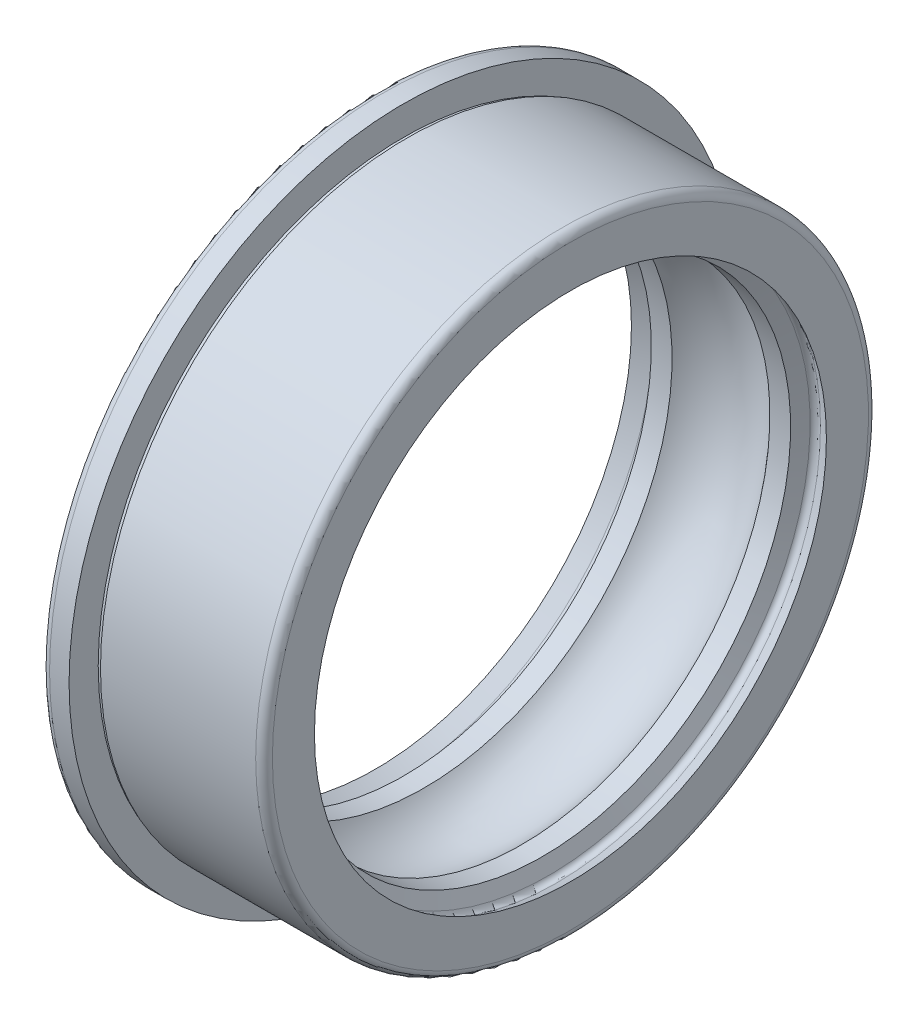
ISO-10303-21;
HEADER;
FILE_DESCRIPTION(('STEP AP214'),'2;1');
FILE_NAME('part.step','',(''),(''),'','','');
FILE_SCHEMA(('AUTOMOTIVE_DESIGN { 1 0 10303 214 1 1 1 1 }'));
ENDSEC;
DATA;
#1=APPLICATION_CONTEXT('core data for automotive mechanical design processes');
#2=APPLICATION_PROTOCOL_DEFINITION('international standard','automotive_design',2000,#1);
#3=PRODUCT_CONTEXT('',#1,'mechanical');
#4=PRODUCT('Part','Part','',(#3));
#5=PRODUCT_RELATED_PRODUCT_CATEGORY('part','',(#4));
#6=PRODUCT_DEFINITION_FORMATION('','',#4);
#7=PRODUCT_DEFINITION_CONTEXT('part definition',#1,'design');
#8=PRODUCT_DEFINITION('design','',#6,#7);
#9=PRODUCT_DEFINITION_SHAPE('','',#8);
#10=(LENGTH_UNIT() NAMED_UNIT(*) SI_UNIT(.MILLI.,.METRE.));
#11=(NAMED_UNIT(*) PLANE_ANGLE_UNIT() SI_UNIT($,.RADIAN.));
#12=(NAMED_UNIT(*) SI_UNIT($,.STERADIAN.) SOLID_ANGLE_UNIT());
#13=UNCERTAINTY_MEASURE_WITH_UNIT(LENGTH_MEASURE(1.E-05),#10,'distance_accuracy_value','');
#14=(GEOMETRIC_REPRESENTATION_CONTEXT(3) GLOBAL_UNCERTAINTY_ASSIGNED_CONTEXT((#13)) GLOBAL_UNIT_ASSIGNED_CONTEXT((#10,
#11,#12)) REPRESENTATION_CONTEXT('',''));
#15=CARTESIAN_POINT('',(0.,0.,0.));
#16=DIRECTION('',(0.,0.,1.));
#17=DIRECTION('',(1.,0.,0.));
#18=AXIS2_PLACEMENT_3D('',#15,#16,#17);
#19=CARTESIAN_POINT('',(0.6,0.,0.));
#20=DIRECTION('',(-1.,0.,0.));
#21=DIRECTION('',(0.,0.,1.));
#22=AXIS2_PLACEMENT_3D('',#19,#20,#21);
#23=TOROIDAL_SURFACE('',#22,9.30625000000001,0.2);
#24=CARTESIAN_POINT('',(0.782287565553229,0.,0.));
#25=DIRECTION('',(-1.,0.,0.));
#26=DIRECTION('',(0.,0.,1.));
#27=AXIS2_PLACEMENT_3D('',#24,#25,#26);
#28=CIRCLE('',#27,9.38853756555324);
#29=CARTESIAN_POINT('',(0.782287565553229,0.,9.38853756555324));
#30=VERTEX_POINT('',#29);
#31=EDGE_CURVE('E10',#30,#30,#28,.T.);
#32=ORIENTED_EDGE('',*,*,#31,.F.);
#33=EDGE_LOOP('',(#32));
#34=FACE_BOUND('',#33,.T.);
#35=CARTESIAN_POINT('',(0.5,0.,0.));
#36=DIRECTION('',(-1.,0.,0.));
#37=DIRECTION('',(0.,0.,1.));
#38=AXIS2_PLACEMENT_3D('',#35,#36,#37);
#39=CIRCLE('',#38,9.4794550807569);
#40=CARTESIAN_POINT('',(0.5,0.,9.4794550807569));
#41=VERTEX_POINT('',#40);
#42=EDGE_CURVE('E89',#41,#41,#39,.T.);
#43=ORIENTED_EDGE('',*,*,#42,.T.);
#44=EDGE_LOOP('',(#43));
#45=FACE_BOUND('',#44,.T.);
#46=ADVANCED_FACE('F31',(#34,#45),#23,.F.);
#47=CARTESIAN_POINT('',(0.782287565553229,0.,0.));
#48=DIRECTION('',(-1.,0.,0.));
#49=DIRECTION('',(0.,0.,1.));
#50=AXIS2_PLACEMENT_3D('',#47,#48,#49);
#51=CONICAL_SURFACE('',#50,9.38853756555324,1.14676528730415);
#52=CARTESIAN_POINT('',(1.,0.,0.));
#53=DIRECTION('',(-1.,0.,0.));
#54=DIRECTION('',(0.,0.,1.));
#55=AXIS2_PLACEMENT_3D('',#52,#53,#54);
#56=CIRCLE('',#55,8.90625000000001);
#57=CARTESIAN_POINT('',(1.,0.,8.90625000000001));
#58=VERTEX_POINT('',#57);
#59=EDGE_CURVE('E37',#58,#58,#56,.T.);
#60=ORIENTED_EDGE('',*,*,#59,.F.);
#61=EDGE_LOOP('',(#60));
#62=FACE_BOUND('',#61,.T.);
#63=ORIENTED_EDGE('',*,*,#31,.T.);
#64=EDGE_LOOP('',(#63));
#65=FACE_BOUND('',#64,.T.);
#66=ADVANCED_FACE('F186',(#62,#65),#51,.F.);
#67=CARTESIAN_POINT('',(-13.,0.,0.));
#68=DIRECTION('',(-1.,0.,0.));
#69=DIRECTION('',(0.,0.,1.));
#70=AXIS2_PLACEMENT_3D('',#67,#68,#69);
#71=CYLINDRICAL_SURFACE('',#70,8.90625000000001);
#72=CARTESIAN_POINT('',(1.74359431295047,0.,0.));
#73=DIRECTION('',(-1.,0.,0.));
#74=DIRECTION('',(0.,0.,1.));
#75=AXIS2_PLACEMENT_3D('',#72,#73,#74);
#76=CIRCLE('',#75,8.90625000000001);
#77=CARTESIAN_POINT('',(1.74359431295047,0.,8.90625000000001));
#78=VERTEX_POINT('',#77);
#79=EDGE_CURVE('E41',#78,#78,#76,.T.);
#80=ORIENTED_EDGE('',*,*,#79,.F.);
#81=EDGE_LOOP('',(#80));
#82=FACE_BOUND('',#81,.T.);
#83=ORIENTED_EDGE('',*,*,#59,.T.);
#84=EDGE_LOOP('',(#83));
#85=FACE_BOUND('',#84,.T.);
#86=ADVANCED_FACE('F181',(#82,#85),#71,.F.);
#87=CARTESIAN_POINT('',(3.5,0.,0.));
#88=DIRECTION('',(-1.,0.,0.));
#89=DIRECTION('',(0.,0.,1.));
#90=AXIS2_PLACEMENT_3D('',#87,#88,#89);
#91=TOROIDAL_SURFACE('',#90,7.5,2.25);
#92=CARTESIAN_POINT('',(5.25640568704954,0.,0.));
#93=DIRECTION('',(-1.,0.,0.));
#94=DIRECTION('',(0.,0.,1.));
#95=AXIS2_PLACEMENT_3D('',#92,#93,#94);
#96=CIRCLE('',#95,8.90625000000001);
#97=CARTESIAN_POINT('',(5.25640568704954,0.,8.90625000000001));
#98=VERTEX_POINT('',#97);
#99=EDGE_CURVE('E45',#98,#98,#96,.T.);
#100=ORIENTED_EDGE('',*,*,#99,.F.);
#101=EDGE_LOOP('',(#100));
#102=FACE_BOUND('',#101,.T.);
#103=ORIENTED_EDGE('',*,*,#79,.T.);
#104=EDGE_LOOP('',(#103));
#105=FACE_BOUND('',#104,.T.);
#106=ADVANCED_FACE('F175',(#102,#105),#91,.F.);
#107=CARTESIAN_POINT('',(-13.,0.,0.));
#108=DIRECTION('',(-1.,0.,0.));
#109=DIRECTION('',(0.,0.,1.));
#110=AXIS2_PLACEMENT_3D('',#107,#108,#109);
#111=CYLINDRICAL_SURFACE('',#110,8.90625000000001);
#112=CARTESIAN_POINT('',(6.,0.,0.));
#113=DIRECTION('',(-1.,0.,0.));
#114=DIRECTION('',(0.,0.,1.));
#115=AXIS2_PLACEMENT_3D('',#112,#113,#114);
#116=CIRCLE('',#115,8.90625000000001);
#117=CARTESIAN_POINT('',(6.,0.,8.90625000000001));
#118=VERTEX_POINT('',#117);
#119=EDGE_CURVE('E50',#118,#118,#116,.T.);
#120=ORIENTED_EDGE('',*,*,#119,.F.);
#121=EDGE_LOOP('',(#120));
#122=FACE_BOUND('',#121,.T.);
#123=ORIENTED_EDGE('',*,*,#99,.T.);
#124=EDGE_LOOP('',(#123));
#125=FACE_BOUND('',#124,.T.);
#126=ADVANCED_FACE('F169',(#122,#125),#111,.F.);
#127=CARTESIAN_POINT('',(6.,0.,0.));
#128=DIRECTION('',(1.,0.,0.));
#129=DIRECTION('',(0.,0.,-1.));
#130=AXIS2_PLACEMENT_3D('',#127,#128,#129);
#131=CONICAL_SURFACE('',#130,8.90625000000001,1.14676528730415);
#132=CARTESIAN_POINT('',(6.21771243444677,0.,0.));
#133=DIRECTION('',(-1.,0.,0.));
#134=DIRECTION('',(0.,0.,1.));
#135=AXIS2_PLACEMENT_3D('',#132,#133,#134);
#136=CIRCLE('',#135,9.38853756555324);
#137=CARTESIAN_POINT('',(6.21771243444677,0.,9.38853756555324));
#138=VERTEX_POINT('',#137);
#139=EDGE_CURVE('E53',#138,#138,#136,.T.);
#140=ORIENTED_EDGE('',*,*,#139,.F.);
#141=EDGE_LOOP('',(#140));
#142=FACE_BOUND('',#141,.T.);
#143=ORIENTED_EDGE('',*,*,#119,.T.);
#144=EDGE_LOOP('',(#143));
#145=FACE_BOUND('',#144,.T.);
#146=ADVANCED_FACE('F163',(#142,#145),#131,.F.);
#147=CARTESIAN_POINT('',(6.4,0.,0.));
#148=DIRECTION('',(-1.,0.,0.));
#149=DIRECTION('',(0.,0.,1.));
#150=AXIS2_PLACEMENT_3D('',#147,#148,#149);
#151=TOROIDAL_SURFACE('',#150,9.30625000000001,0.2);
#152=CARTESIAN_POINT('',(6.5,0.,0.));
#153=DIRECTION('',(-1.,0.,0.));
#154=DIRECTION('',(0.,0.,1.));
#155=AXIS2_PLACEMENT_3D('',#152,#153,#154);
#156=CIRCLE('',#155,9.4794550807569);
#157=CARTESIAN_POINT('',(6.5,0.,9.4794550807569));
#158=VERTEX_POINT('',#157);
#159=EDGE_CURVE('E56',#158,#158,#156,.T.);
#160=ORIENTED_EDGE('',*,*,#159,.F.);
#161=EDGE_LOOP('',(#160));
#162=FACE_BOUND('',#161,.T.);
#163=ORIENTED_EDGE('',*,*,#139,.T.);
#164=EDGE_LOOP('',(#163));
#165=FACE_BOUND('',#164,.T.);
#166=ADVANCED_FACE('F157',(#162,#165),#151,.F.);
#167=CARTESIAN_POINT('',(6.5,0.,0.));
#168=DIRECTION('',(-1.,0.,0.));
#169=DIRECTION('',(0.,0.,1.));
#170=AXIS2_PLACEMENT_3D('',#167,#168,#169);
#171=CONICAL_SURFACE('',#170,9.4794550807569,0.523598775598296);
#172=CARTESIAN_POINT('',(7.,0.,0.));
#173=DIRECTION('',(-1.,0.,0.));
#174=DIRECTION('',(0.,0.,1.));
#175=AXIS2_PLACEMENT_3D('',#172,#173,#174);
#176=CIRCLE('',#175,9.19077994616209);
#177=CARTESIAN_POINT('',(7.,0.,9.19077994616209));
#178=VERTEX_POINT('',#177);
#179=EDGE_CURVE('E59',#178,#178,#176,.T.);
#180=ORIENTED_EDGE('',*,*,#179,.F.);
#181=EDGE_LOOP('',(#180));
#182=FACE_BOUND('',#181,.T.);
#183=ORIENTED_EDGE('',*,*,#159,.T.);
#184=EDGE_LOOP('',(#183));
#185=FACE_BOUND('',#184,.T.);
#186=ADVANCED_FACE('F151',(#182,#185),#171,.F.);
#187=CARTESIAN_POINT('',(7.,10.7,0.));
#188=DIRECTION('',(-1.,0.,0.));
#189=DIRECTION('',(0.,0.,1.));
#190=AXIS2_PLACEMENT_3D('',#187,#188,#189);
#191=PLANE('',#190);
#192=CARTESIAN_POINT('',(7.,0.,0.));
#193=DIRECTION('',(-1.,0.,0.));
#194=DIRECTION('',(0.,0.,1.));
#195=AXIS2_PLACEMENT_3D('',#192,#193,#194);
#196=CIRCLE('',#195,10.7);
#197=CARTESIAN_POINT('',(7.,0.,10.7));
#198=VERTEX_POINT('',#197);
#199=EDGE_CURVE('E62',#198,#198,#196,.T.);
#200=ORIENTED_EDGE('',*,*,#199,.F.);
#201=EDGE_LOOP('',(#200));
#202=FACE_BOUND('',#201,.T.);
#203=ORIENTED_EDGE('',*,*,#179,.T.);
#204=EDGE_LOOP('',(#203));
#205=FACE_BOUND('',#204,.T.);
#206=ADVANCED_FACE('F145',(#202,#205),#191,.F.);
#207=CARTESIAN_POINT('',(6.7,0.,0.));
#208=DIRECTION('',(-1.,0.,0.));
#209=DIRECTION('',(0.,0.,1.));
#210=AXIS2_PLACEMENT_3D('',#207,#208,#209);
#211=TOROIDAL_SURFACE('',#210,10.7,0.300000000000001);
#212=CARTESIAN_POINT('',(6.7,0.,0.));
#213=DIRECTION('',(-1.,0.,0.));
#214=DIRECTION('',(0.,0.,1.));
#215=AXIS2_PLACEMENT_3D('',#212,#213,#214);
#216=CIRCLE('',#215,11.);
#217=CARTESIAN_POINT('',(6.7,0.,11.));
#218=VERTEX_POINT('',#217);
#219=EDGE_CURVE('E65',#218,#218,#216,.T.);
#220=ORIENTED_EDGE('',*,*,#219,.F.);
#221=EDGE_LOOP('',(#220));
#222=FACE_BOUND('',#221,.T.);
#223=ORIENTED_EDGE('',*,*,#199,.T.);
#224=EDGE_LOOP('',(#223));
#225=FACE_BOUND('',#224,.T.);
#226=ADVANCED_FACE('F139',(#222,#225),#211,.T.);
#227=CARTESIAN_POINT('',(-13.,0.,0.));
#228=DIRECTION('',(-1.,0.,0.));
#229=DIRECTION('',(0.,0.,1.));
#230=AXIS2_PLACEMENT_3D('',#227,#228,#229);
#231=CYLINDRICAL_SURFACE('',#230,11.);
#232=CARTESIAN_POINT('',(1.1278646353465,0.,0.));
#233=DIRECTION('',(-1.,0.,0.));
#234=DIRECTION('',(0.,0.,1.));
#235=AXIS2_PLACEMENT_3D('',#232,#233,#234);
#236=CIRCLE('',#235,11.);
#237=CARTESIAN_POINT('',(1.1278646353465,0.,11.));
#238=VERTEX_POINT('',#237);
#239=EDGE_CURVE('E68',#238,#238,#236,.T.);
#240=ORIENTED_EDGE('',*,*,#239,.F.);
#241=EDGE_LOOP('',(#240));
#242=FACE_BOUND('',#241,.T.);
#243=ORIENTED_EDGE('',*,*,#219,.T.);
#244=EDGE_LOOP('',(#243));
#245=FACE_BOUND('',#244,.T.);
#246=ADVANCED_FACE('F133',(#242,#245),#231,.T.);
#247=CARTESIAN_POINT('',(1.1278646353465,11.,0.));
#248=DIRECTION('',(1.,0.,0.));
#249=DIRECTION('',(0.,0.,-1.));
#250=AXIS2_PLACEMENT_3D('',#247,#248,#249);
#251=PLANE('',#250);
#252=CARTESIAN_POINT('',(1.1278646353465,0.,0.));
#253=DIRECTION('',(-1.,0.,0.));
#254=DIRECTION('',(0.,0.,1.));
#255=AXIS2_PLACEMENT_3D('',#252,#253,#254);
#256=CIRCLE('',#255,10.9527940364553);
#257=CARTESIAN_POINT('',(1.1278646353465,0.,10.9527940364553));
#258=VERTEX_POINT('',#257);
#259=EDGE_CURVE('E71',#258,#258,#256,.T.);
#260=ORIENTED_EDGE('',*,*,#259,.F.);
#261=EDGE_LOOP('',(#260));
#262=FACE_BOUND('',#261,.T.);
#263=ORIENTED_EDGE('',*,*,#239,.T.);
#264=EDGE_LOOP('',(#263));
#265=FACE_BOUND('',#264,.T.);
#266=ADVANCED_FACE('F127',(#262,#265),#251,.F.);
#267=CARTESIAN_POINT('',(-13.,0.,0.));
#268=DIRECTION('',(-1.,0.,0.));
#269=DIRECTION('',(0.,0.,1.));
#270=AXIS2_PLACEMENT_3D('',#267,#268,#269);
#271=CYLINDRICAL_SURFACE('',#270,10.9527940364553);
#272=CARTESIAN_POINT('',(1.,0.,0.));
#273=DIRECTION('',(-1.,0.,0.));
#274=DIRECTION('',(0.,0.,1.));
#275=AXIS2_PLACEMENT_3D('',#272,#273,#274);
#276=CIRCLE('',#275,10.9527940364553);
#277=CARTESIAN_POINT('',(1.,0.,10.9527940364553));
#278=VERTEX_POINT('',#277);
#279=EDGE_CURVE('E74',#278,#278,#276,.T.);
#280=ORIENTED_EDGE('',*,*,#279,.F.);
#281=EDGE_LOOP('',(#280));
#282=FACE_BOUND('',#281,.T.);
#283=ORIENTED_EDGE('',*,*,#259,.T.);
#284=EDGE_LOOP('',(#283));
#285=FACE_BOUND('',#284,.T.);
#286=ADVANCED_FACE('F121',(#282,#285),#271,.T.);
#287=CARTESIAN_POINT('',(1.,12.,0.));
#288=DIRECTION('',(-1.,0.,0.));
#289=DIRECTION('',(0.,0.,1.));
#290=AXIS2_PLACEMENT_3D('',#287,#288,#289);
#291=PLANE('',#290);
#292=CARTESIAN_POINT('',(1.,0.,0.));
#293=DIRECTION('',(-1.,0.,0.));
#294=DIRECTION('',(0.,0.,1.));
#295=AXIS2_PLACEMENT_3D('',#292,#293,#294);
#296=CIRCLE('',#295,12.);
#297=CARTESIAN_POINT('',(1.,0.,12.));
#298=VERTEX_POINT('',#297);
#299=EDGE_CURVE('E77',#298,#298,#296,.T.);
#300=ORIENTED_EDGE('',*,*,#299,.F.);
#301=EDGE_LOOP('',(#300));
#302=FACE_BOUND('',#301,.T.);
#303=ORIENTED_EDGE('',*,*,#279,.T.);
#304=EDGE_LOOP('',(#303));
#305=FACE_BOUND('',#304,.T.);
#306=ADVANCED_FACE('F115',(#302,#305),#291,.F.);
#307=CARTESIAN_POINT('',(-13.,0.,0.));
#308=DIRECTION('',(-1.,0.,0.));
#309=DIRECTION('',(0.,0.,1.));
#310=AXIS2_PLACEMENT_3D('',#307,#308,#309);
#311=CYLINDRICAL_SURFACE('',#310,12.);
#312=CARTESIAN_POINT('',(0.3,0.,0.));
#313=DIRECTION('',(-1.,0.,0.));
#314=DIRECTION('',(0.,0.,1.));
#315=AXIS2_PLACEMENT_3D('',#312,#313,#314);
#316=CIRCLE('',#315,12.);
#317=CARTESIAN_POINT('',(0.3,0.,12.));
#318=VERTEX_POINT('',#317);
#319=EDGE_CURVE('E80',#318,#318,#316,.T.);
#320=ORIENTED_EDGE('',*,*,#319,.F.);
#321=EDGE_LOOP('',(#320));
#322=FACE_BOUND('',#321,.T.);
#323=ORIENTED_EDGE('',*,*,#299,.T.);
#324=EDGE_LOOP('',(#323));
#325=FACE_BOUND('',#324,.T.);
#326=ADVANCED_FACE('F109',(#322,#325),#311,.T.);
#327=CARTESIAN_POINT('',(0.3,0.,0.));
#328=DIRECTION('',(-1.,0.,0.));
#329=DIRECTION('',(0.,0.,1.));
#330=AXIS2_PLACEMENT_3D('',#327,#328,#329);
#331=TOROIDAL_SURFACE('',#330,11.7,0.3);
#332=CARTESIAN_POINT('',(0.,0.,0.));
#333=DIRECTION('',(-1.,0.,0.));
#334=DIRECTION('',(0.,0.,1.));
#335=AXIS2_PLACEMENT_3D('',#332,#333,#334);
#336=CIRCLE('',#335,11.7);
#337=CARTESIAN_POINT('',(0.,0.,11.7));
#338=VERTEX_POINT('',#337);
#339=EDGE_CURVE('E83',#338,#338,#336,.T.);
#340=ORIENTED_EDGE('',*,*,#339,.F.);
#341=EDGE_LOOP('',(#340));
#342=FACE_BOUND('',#341,.T.);
#343=ORIENTED_EDGE('',*,*,#319,.T.);
#344=EDGE_LOOP('',(#343));
#345=FACE_BOUND('',#344,.T.);
#346=ADVANCED_FACE('F103',(#342,#345),#331,.T.);
#347=CARTESIAN_POINT('',(0.,9.19077994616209,0.));
#348=DIRECTION('',(1.,0.,0.));
#349=DIRECTION('',(0.,0.,-1.));
#350=AXIS2_PLACEMENT_3D('',#347,#348,#349);
#351=PLANE('',#350);
#352=CARTESIAN_POINT('',(0.,0.,0.));
#353=DIRECTION('',(-1.,0.,0.));
#354=DIRECTION('',(0.,0.,1.));
#355=AXIS2_PLACEMENT_3D('',#352,#353,#354);
#356=CIRCLE('',#355,9.19077994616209);
#357=CARTESIAN_POINT('',(0.,0.,9.19077994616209));
#358=VERTEX_POINT('',#357);
#359=EDGE_CURVE('E86',#358,#358,#356,.T.);
#360=ORIENTED_EDGE('',*,*,#359,.F.);
#361=EDGE_LOOP('',(#360));
#362=FACE_BOUND('',#361,.T.);
#363=ORIENTED_EDGE('',*,*,#339,.T.);
#364=EDGE_LOOP('',(#363));
#365=FACE_BOUND('',#364,.T.);
#366=ADVANCED_FACE('F97',(#362,#365),#351,.F.);
#367=CARTESIAN_POINT('',(0.,0.,0.));
#368=DIRECTION('',(1.,0.,0.));
#369=DIRECTION('',(0.,0.,-1.));
#370=AXIS2_PLACEMENT_3D('',#367,#368,#369);
#371=CONICAL_SURFACE('',#370,9.19077994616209,0.523598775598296);
#372=ORIENTED_EDGE('',*,*,#42,.F.);
#373=EDGE_LOOP('',(#372));
#374=FACE_BOUND('',#373,.T.);
#375=ORIENTED_EDGE('',*,*,#359,.T.);
#376=EDGE_LOOP('',(#375));
#377=FACE_BOUND('',#376,.T.);
#378=ADVANCED_FACE('F94',(#374,#377),#371,.F.);
#379=CLOSED_SHELL('',(#46,#66,#86,#106,#126,#146,#166,#186,#206,#226,#246,#266,#286,#306,#326,
#346,#366,#378));
#380=MANIFOLD_SOLID_BREP('B2',#379);
#381=ADVANCED_BREP_SHAPE_REPRESENTATION('',(#18,#380),#14);
#382=SHAPE_DEFINITION_REPRESENTATION(#9,#381);
ENDSEC;
END-ISO-10303-21;
